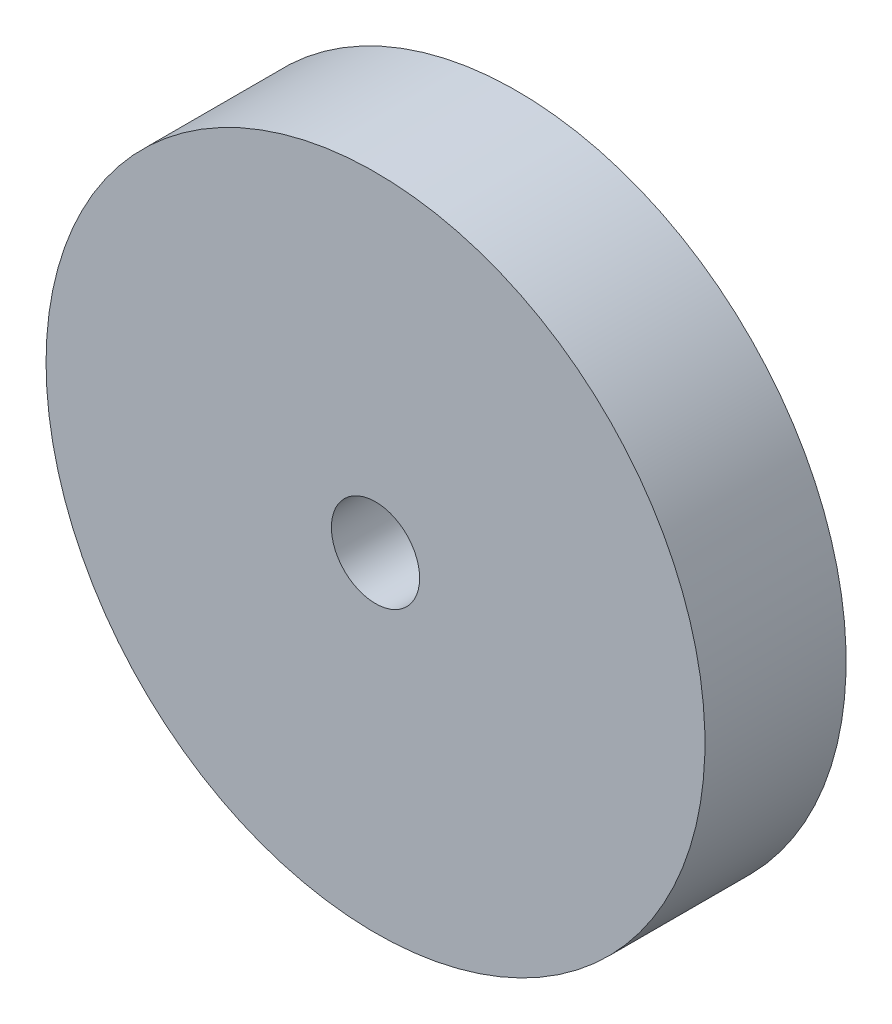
from build123d import *

# Parameters (mm, degrees)
SKETCH1_R           = 22.225
BOSS_EXTRUDE1_DEPTH = 9.525
SKETCH2_R           = 2.9765625
CUT_EXTRUDE1_DEPTH  = 9.525


with BuildPart() as part:
    # Sketch1 → Boss-Extrude1 (new body)
    with BuildSketch(Plane.XY.offset(392.692440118)):
        with Locations(Location((30.953420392, 4.221240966, 0), (0, 0, 180))):
            Circle(SKETCH1_R)
    extrude(amount=BOSS_EXTRUDE1_DEPTH)

    # Sketch2 → Cut-Extrude1 (cut)
    with BuildSketch(Plane.XY.offset(402.217440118)):
        with Locations((30.953420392, 4.221240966)):
            Circle(SKETCH2_R)
    extrude(amount=-CUT_EXTRUDE1_DEPTH, mode=Mode.SUBTRACT)


solid = part.part
